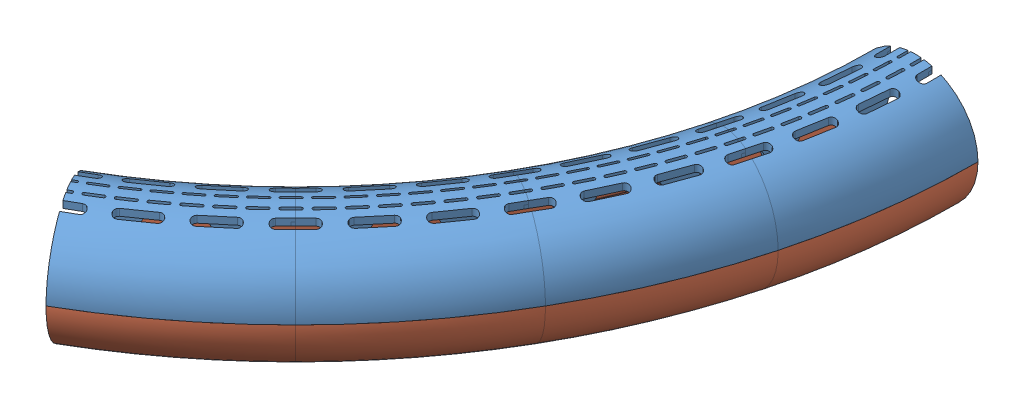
SolidWorks assembly min_60.SLDASM, configuration По умолчанию (file format 12000). Lengths in mm.
Overall size (107.47 30 155.21).
18 component instances, 3 part files, 2 mates.
Components (placement in the parent):
- min_30-1: min_30.SLDASM [По умолчанию] at (44.5693 18.1969 -4.1969) size (50.1 30 83.96)
  - min_15-1: min_15.SLDASM [По умолчанию] at (0.8046 0.6477 0.6225) size (34.6 30 42.71)
    - min_frame-1: min_frame.SLDPRT [По умолчанию] at (-122.2259 30.5048 -5.4377) size (34.6 25.85 42.71)
    - min_glass-1: min_glass.SLDPRT [По умолчанию] at (-122.2259 30.5048 -5.4377) size (34.6 15.78 42.71)
    - min_led-1: min_led.SLDPRT [По умолчанию] at (-122.2259 30.5048 -5.4377) size (13.66 10 39.95)
  - min_15-2: min_15.SLDASM [По умолчанию] at (-4.7675 0.6477 32.0716) x (0.965926 0 0.258819) z (-0.258819 0 0.965926) size (34.6 30 42.71)
    - min_frame-1: min_frame.SLDPRT [По умолчанию] at (-122.2259 30.5048 -5.4377) size (34.6 25.85 42.71)
    - min_glass-1: min_glass.SLDPRT [По умолчанию] at (-122.2259 30.5048 -5.4377) size (34.6 15.78 42.71)
    - min_led-1: min_led.SLDPRT [По умолчанию] at (-122.2259 30.5048 -5.4377) size (13.66 10 39.95)
- min_30-2: min_30.SLDASM [По умолчанию] at (25.8943 18.1969 55.8686) x (0.866025 0 0.5) z (-0.5 0 0.866025) size (50.1 30 83.96)
  - min_15-1: min_15.SLDASM [По умолчанию] at (0.8046 0.6477 0.6225) size (34.6 30 42.71)
    - min_frame-1: min_frame.SLDPRT [По умолчанию] at (-122.2259 30.5048 -5.4377) size (34.6 25.85 42.71)
    - min_glass-1: min_glass.SLDPRT [По умолчанию] at (-122.2259 30.5048 -5.4377) size (34.6 15.78 42.71)
    - min_led-1: min_led.SLDPRT [По умолчанию] at (-122.2259 30.5048 -5.4377) size (13.66 10 39.95)
  - min_15-2: min_15.SLDASM [По умолчанию] at (-4.7675 0.6477 32.0716) x (0.965926 0 0.258819) z (-0.258819 0 0.965926) size (34.6 30 42.71)
    - min_frame-1: min_frame.SLDPRT [По умолчанию] at (-122.2259 30.5048 -5.4377) size (34.6 25.85 42.71)
    - min_glass-1: min_glass.SLDPRT [По умолчанию] at (-122.2259 30.5048 -5.4377) size (34.6 15.78 42.71)
    - min_led-1: min_led.SLDPRT [По умолчанию] at (-122.2259 30.5048 -5.4377) size (13.66 10 39.95)
Mates (geometry in assembly coordinates):
- Совпадение1: coincident: circle of 30-1/15-2/min_frame-1; circle of 30-2/15-1/min_frame-1
- Совпадение2: coincident: point of 30-1/15-2/min_frame-1; point of 30-2/15-1/min_frame-1
